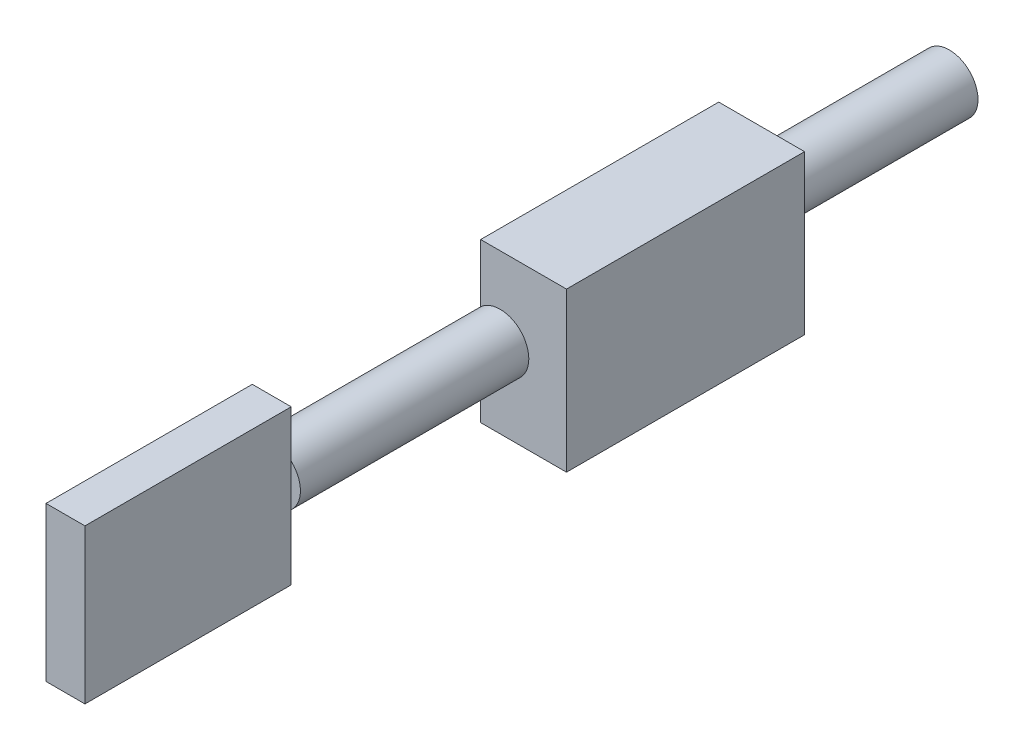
ISO-10303-21;
HEADER;
FILE_DESCRIPTION(('STEP AP214'),'2;1');
FILE_NAME('part.step','',(''),(''),'','','');
FILE_SCHEMA(('AUTOMOTIVE_DESIGN { 1 0 10303 214 1 1 1 1 }'));
ENDSEC;
DATA;
#1=APPLICATION_CONTEXT('core data for automotive mechanical design processes');
#2=APPLICATION_PROTOCOL_DEFINITION('international standard','automotive_design',2000,#1);
#3=PRODUCT_CONTEXT('',#1,'mechanical');
#4=PRODUCT('Part','Part','',(#3));
#5=PRODUCT_RELATED_PRODUCT_CATEGORY('part','',(#4));
#6=PRODUCT_DEFINITION_FORMATION('','',#4);
#7=PRODUCT_DEFINITION_CONTEXT('part definition',#1,'design');
#8=PRODUCT_DEFINITION('design','',#6,#7);
#9=PRODUCT_DEFINITION_SHAPE('','',#8);
#10=(LENGTH_UNIT() NAMED_UNIT(*) SI_UNIT(.MILLI.,.METRE.));
#11=(NAMED_UNIT(*) PLANE_ANGLE_UNIT() SI_UNIT($,.RADIAN.));
#12=(NAMED_UNIT(*) SI_UNIT($,.STERADIAN.) SOLID_ANGLE_UNIT());
#13=UNCERTAINTY_MEASURE_WITH_UNIT(LENGTH_MEASURE(1.E-05),#10,'distance_accuracy_value','');
#14=(GEOMETRIC_REPRESENTATION_CONTEXT(3) GLOBAL_UNCERTAINTY_ASSIGNED_CONTEXT((#13)) GLOBAL_UNIT_ASSIGNED_CONTEXT((#10,
#11,#12)) REPRESENTATION_CONTEXT('',''));
#15=CARTESIAN_POINT('',(0.,0.,0.));
#16=DIRECTION('',(0.,0.,1.));
#17=DIRECTION('',(1.,0.,0.));
#18=AXIS2_PLACEMENT_3D('',#15,#16,#17);
#19=CARTESIAN_POINT('',(0.,0.,121.740764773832));
#20=DIRECTION('',(0.,0.,-1.));
#21=DIRECTION('',(-1.,0.,0.));
#22=AXIS2_PLACEMENT_3D('',#19,#20,#21);
#23=CYLINDRICAL_SURFACE('',#22,4.6);
#24=CARTESIAN_POINT('',(0.,0.,108.73));
#25=DIRECTION('',(0.,0.,1.));
#26=DIRECTION('',(1.,0.,0.));
#27=AXIS2_PLACEMENT_3D('',#24,#25,#26);
#28=CIRCLE('',#27,4.6);
#29=CARTESIAN_POINT('',(3.125,3.37555550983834,108.73));
#30=VERTEX_POINT('',#29);
#31=CARTESIAN_POINT('',(-3.125,3.37555550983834,108.73));
#32=VERTEX_POINT('',#31);
#33=EDGE_CURVE('E218',#30,#32,#28,.T.);
#34=ORIENTED_EDGE('',*,*,#33,.F.);
#35=CARTESIAN_POINT('',(3.125,-3.37555550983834,108.73));
#36=VERTEX_POINT('',#35);
#37=EDGE_CURVE('E217',#36,#30,#28,.T.);
#38=ORIENTED_EDGE('',*,*,#37,.F.);
#39=CARTESIAN_POINT('',(-3.125,-3.37555550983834,108.73));
#40=VERTEX_POINT('',#39);
#41=EDGE_CURVE('E223',#40,#36,#28,.T.);
#42=ORIENTED_EDGE('',*,*,#41,.F.);
#43=EDGE_CURVE('E222',#32,#40,#28,.T.);
#44=ORIENTED_EDGE('',*,*,#43,.F.);
#45=EDGE_LOOP('',(#34,#38,#42,#44));
#46=FACE_BOUND('',#45,.T.);
#47=CARTESIAN_POINT('',(0.,0.,0.));
#48=DIRECTION('',(0.,0.,1.));
#49=DIRECTION('',(1.,0.,0.));
#50=AXIS2_PLACEMENT_3D('',#47,#48,#49);
#51=CIRCLE('',#50,4.6);
#52=CARTESIAN_POINT('',(4.6,0.,0.));
#53=VERTEX_POINT('',#52);
#54=EDGE_CURVE('E214',#53,#53,#51,.T.);
#55=ORIENTED_EDGE('',*,*,#54,.T.);
#56=EDGE_LOOP('',(#55));
#57=FACE_BOUND('',#56,.T.);
#58=DIRECTION('',(0.,0.,-1.));
#59=VECTOR('',#58,1.);
#60=CARTESIAN_POINT('',(-3.125,-3.37555550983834,121.740764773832));
#61=LINE('',#60,#59);
#62=CARTESIAN_POINT('',(-3.125,-3.37555550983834,72.08));
#63=VERTEX_POINT('',#62);
#64=CARTESIAN_POINT('',(-3.125,-3.37555550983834,33.88));
#65=VERTEX_POINT('',#64);
#66=EDGE_CURVE('E14',#63,#65,#61,.T.);
#67=ORIENTED_EDGE('',*,*,#66,.F.);
#68=CARTESIAN_POINT('',(0.,0.,72.08));
#69=DIRECTION('',(0.,0.,-1.));
#70=DIRECTION('',(-1.,0.,0.));
#71=AXIS2_PLACEMENT_3D('',#68,#69,#70);
#72=CIRCLE('',#71,4.6);
#73=CARTESIAN_POINT('',(-3.125,3.37555550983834,72.08));
#74=VERTEX_POINT('',#73);
#75=EDGE_CURVE('E60',#74,#63,#72,.T.);
#76=ORIENTED_EDGE('',*,*,#75,.F.);
#77=DIRECTION('',(0.,0.,-1.));
#78=VECTOR('',#77,1.);
#79=CARTESIAN_POINT('',(-3.125,3.37555550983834,121.740764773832));
#80=LINE('',#79,#78);
#81=CARTESIAN_POINT('',(-3.125,3.37555550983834,33.88));
#82=VERTEX_POINT('',#81);
#83=EDGE_CURVE('E267',#82,#74,#80,.F.);
#84=ORIENTED_EDGE('',*,*,#83,.F.);
#85=CARTESIAN_POINT('',(0.,0.,33.88));
#86=DIRECTION('',(0.,0.,1.));
#87=DIRECTION('',(1.,0.,0.));
#88=AXIS2_PLACEMENT_3D('',#85,#86,#87);
#89=CIRCLE('',#88,4.6);
#90=EDGE_CURVE('E75',#65,#82,#89,.T.);
#91=ORIENTED_EDGE('',*,*,#90,.F.);
#92=EDGE_LOOP('',(#67,#76,#84,#91));
#93=FACE_BOUND('',#92,.T.);
#94=ADVANCED_FACE('F51',(#46,#57,#93),#23,.T.);
#95=CARTESIAN_POINT('',(3.125,10.93,108.73));
#96=DIRECTION('',(0.,0.,1.));
#97=DIRECTION('',(1.,0.,0.));
#98=AXIS2_PLACEMENT_3D('',#95,#96,#97);
#99=PLANE('',#98);
#100=DIRECTION('',(0.,1.,0.));
#101=VECTOR('',#100,1.);
#102=CARTESIAN_POINT('',(3.125,10.93,108.73));
#103=LINE('',#102,#101);
#104=CARTESIAN_POINT('',(3.125,10.93,108.73));
#105=VERTEX_POINT('',#104);
#106=EDGE_CURVE('E231',#30,#105,#103,.T.);
#107=ORIENTED_EDGE('',*,*,#106,.F.);
#108=ORIENTED_EDGE('',*,*,#33,.T.);
#109=DIRECTION('',(0.,1.,0.));
#110=VECTOR('',#109,1.);
#111=CARTESIAN_POINT('',(-3.125,10.93,108.73));
#112=LINE('',#111,#110);
#113=CARTESIAN_POINT('',(-3.125,10.93,108.73));
#114=VERTEX_POINT('',#113);
#115=EDGE_CURVE('E246',#32,#114,#112,.T.);
#116=ORIENTED_EDGE('',*,*,#115,.T.);
#117=DIRECTION('',(-1.,0.,0.));
#118=VECTOR('',#117,1.);
#119=CARTESIAN_POINT('',(3.125,10.93,108.73));
#120=LINE('',#119,#118);
#121=EDGE_CURVE('E256',#105,#114,#120,.T.);
#122=ORIENTED_EDGE('',*,*,#121,.F.);
#123=EDGE_LOOP('',(#107,#108,#116,#122));
#124=FACE_BOUND('',#123,.T.);
#125=ADVANCED_FACE('F285',(#124),#99,.F.);
#126=CARTESIAN_POINT('',(3.125,10.93,141.83));
#127=DIRECTION('',(0.,0.,-1.));
#128=DIRECTION('',(-1.,0.,0.));
#129=AXIS2_PLACEMENT_3D('',#126,#127,#128);
#130=PLANE('',#129);
#131=DIRECTION('',(0.,-1.,0.));
#132=VECTOR('',#131,1.);
#133=CARTESIAN_POINT('',(-3.125,10.93,141.83));
#134=LINE('',#133,#132);
#135=CARTESIAN_POINT('',(-3.125,10.93,141.83));
#136=VERTEX_POINT('',#135);
#137=CARTESIAN_POINT('',(-3.125,-13.82,141.83));
#138=VERTEX_POINT('',#137);
#139=EDGE_CURVE('E221',#136,#138,#134,.T.);
#140=ORIENTED_EDGE('',*,*,#139,.T.);
#141=DIRECTION('',(-1.,0.,0.));
#142=VECTOR('',#141,1.);
#143=CARTESIAN_POINT('',(3.125,-13.82,141.83));
#144=LINE('',#143,#142);
#145=CARTESIAN_POINT('',(3.125,-13.82,141.83));
#146=VERTEX_POINT('',#145);
#147=EDGE_CURVE('E264',#146,#138,#144,.T.);
#148=ORIENTED_EDGE('',*,*,#147,.F.);
#149=DIRECTION('',(0.,-1.,0.));
#150=VECTOR('',#149,1.);
#151=CARTESIAN_POINT('',(3.125,10.93,141.83));
#152=LINE('',#151,#150);
#153=CARTESIAN_POINT('',(3.125,10.93,141.83));
#154=VERTEX_POINT('',#153);
#155=EDGE_CURVE('E224',#154,#146,#152,.T.);
#156=ORIENTED_EDGE('',*,*,#155,.F.);
#157=DIRECTION('',(-1.,0.,0.));
#158=VECTOR('',#157,1.);
#159=CARTESIAN_POINT('',(3.125,10.93,141.83));
#160=LINE('',#159,#158);
#161=EDGE_CURVE('E240',#154,#136,#160,.T.);
#162=ORIENTED_EDGE('',*,*,#161,.T.);
#163=EDGE_LOOP('',(#140,#148,#156,#162));
#164=FACE_BOUND('',#163,.T.);
#165=ADVANCED_FACE('F53',(#164),#130,.F.);
#166=CARTESIAN_POINT('',(3.125,-13.82,141.83));
#167=DIRECTION('',(0.,1.,0.));
#168=DIRECTION('',(0.,0.,1.));
#169=AXIS2_PLACEMENT_3D('',#166,#167,#168);
#170=PLANE('',#169);
#171=DIRECTION('',(0.,0.,-1.));
#172=VECTOR('',#171,1.);
#173=CARTESIAN_POINT('',(-3.125,-13.82,141.83));
#174=LINE('',#173,#172);
#175=CARTESIAN_POINT('',(-3.125,-13.82,108.73));
#176=VERTEX_POINT('',#175);
#177=EDGE_CURVE('E243',#138,#176,#174,.T.);
#178=ORIENTED_EDGE('',*,*,#177,.T.);
#179=DIRECTION('',(-1.,0.,0.));
#180=VECTOR('',#179,1.);
#181=CARTESIAN_POINT('',(3.125,-13.82,108.73));
#182=LINE('',#181,#180);
#183=CARTESIAN_POINT('',(3.125,-13.82,108.73));
#184=VERTEX_POINT('',#183);
#185=EDGE_CURVE('E260',#184,#176,#182,.T.);
#186=ORIENTED_EDGE('',*,*,#185,.F.);
#187=DIRECTION('',(0.,0.,-1.));
#188=VECTOR('',#187,1.);
#189=CARTESIAN_POINT('',(3.125,-13.82,141.83));
#190=LINE('',#189,#188);
#191=EDGE_CURVE('E227',#146,#184,#190,.T.);
#192=ORIENTED_EDGE('',*,*,#191,.F.);
#193=ORIENTED_EDGE('',*,*,#147,.T.);
#194=EDGE_LOOP('',(#178,#186,#192,#193));
#195=FACE_BOUND('',#194,.T.);
#196=ADVANCED_FACE('F317',(#195),#170,.F.);
#197=EDGE_CURVE('E247',#176,#40,#112,.T.);
#198=ORIENTED_EDGE('',*,*,#197,.T.);
#199=ORIENTED_EDGE('',*,*,#41,.T.);
#200=EDGE_CURVE('E232',#184,#36,#103,.T.);
#201=ORIENTED_EDGE('',*,*,#200,.F.);
#202=ORIENTED_EDGE('',*,*,#185,.T.);
#203=EDGE_LOOP('',(#198,#199,#201,#202));
#204=FACE_BOUND('',#203,.T.);
#205=ADVANCED_FACE('F293',(#204),#99,.F.);
#206=CARTESIAN_POINT('',(3.125,10.93,141.83));
#207=DIRECTION('',(0.,-1.,0.));
#208=DIRECTION('',(0.,0.,-1.));
#209=AXIS2_PLACEMENT_3D('',#206,#207,#208);
#210=PLANE('',#209);
#211=DIRECTION('',(0.,0.,1.));
#212=VECTOR('',#211,1.);
#213=CARTESIAN_POINT('',(-3.125,10.93,141.83));
#214=LINE('',#213,#212);
#215=EDGE_CURVE('E228',#114,#136,#214,.T.);
#216=ORIENTED_EDGE('',*,*,#215,.T.);
#217=ORIENTED_EDGE('',*,*,#161,.F.);
#218=DIRECTION('',(0.,0.,1.));
#219=VECTOR('',#218,1.);
#220=CARTESIAN_POINT('',(3.125,10.93,141.83));
#221=LINE('',#220,#219);
#222=EDGE_CURVE('E236',#105,#154,#221,.T.);
#223=ORIENTED_EDGE('',*,*,#222,.F.);
#224=ORIENTED_EDGE('',*,*,#121,.T.);
#225=EDGE_LOOP('',(#216,#217,#223,#224));
#226=FACE_BOUND('',#225,.T.);
#227=ADVANCED_FACE('F309',(#226),#210,.F.);
#228=CARTESIAN_POINT('',(3.125,0.,0.));
#229=DIRECTION('',(1.,0.,0.));
#230=DIRECTION('',(0.,0.,-1.));
#231=AXIS2_PLACEMENT_3D('',#228,#229,#230);
#232=PLANE('',#231);
#233=ORIENTED_EDGE('',*,*,#155,.T.);
#234=ORIENTED_EDGE('',*,*,#191,.T.);
#235=ORIENTED_EDGE('',*,*,#200,.T.);
#236=EDGE_CURVE('E237',#36,#30,#103,.T.);
#237=ORIENTED_EDGE('',*,*,#236,.T.);
#238=ORIENTED_EDGE('',*,*,#106,.T.);
#239=ORIENTED_EDGE('',*,*,#222,.T.);
#240=EDGE_LOOP('',(#233,#234,#235,#237,#238,#239));
#241=FACE_BOUND('',#240,.T.);
#242=ADVANCED_FACE('F305',(#241),#232,.T.);
#243=CARTESIAN_POINT('',(-3.125,0.,0.));
#244=DIRECTION('',(1.,0.,0.));
#245=DIRECTION('',(0.,0.,-1.));
#246=AXIS2_PLACEMENT_3D('',#243,#244,#245);
#247=PLANE('',#246);
#248=ORIENTED_EDGE('',*,*,#139,.F.);
#249=ORIENTED_EDGE('',*,*,#215,.F.);
#250=ORIENTED_EDGE('',*,*,#115,.F.);
#251=EDGE_CURVE('E251',#40,#32,#112,.T.);
#252=ORIENTED_EDGE('',*,*,#251,.F.);
#253=ORIENTED_EDGE('',*,*,#197,.F.);
#254=ORIENTED_EDGE('',*,*,#177,.F.);
#255=EDGE_LOOP('',(#248,#249,#250,#252,#253,#254));
#256=FACE_BOUND('',#255,.T.);
#257=ADVANCED_FACE('F308',(#256),#247,.F.);
#258=CARTESIAN_POINT('',(3.125,10.93,108.73));
#259=DIRECTION('',(0.,0.,1.));
#260=DIRECTION('',(1.,0.,0.));
#261=AXIS2_PLACEMENT_3D('',#258,#259,#260);
#262=PLANE('',#261);
#263=ORIENTED_EDGE('',*,*,#236,.F.);
#264=ORIENTED_EDGE('',*,*,#37,.T.);
#265=EDGE_LOOP('',(#263,#264));
#266=FACE_BOUND('',#265,.T.);
#267=ADVANCED_FACE('F304',(#266),#262,.T.);
#268=CARTESIAN_POINT('',(0.,0.,0.));
#269=DIRECTION('',(0.,0.,1.));
#270=DIRECTION('',(1.,0.,0.));
#271=AXIS2_PLACEMENT_3D('',#268,#269,#270);
#272=PLANE('',#271);
#273=ORIENTED_EDGE('',*,*,#54,.F.);
#274=EDGE_LOOP('',(#273));
#275=FACE_BOUND('',#274,.T.);
#276=ADVANCED_FACE('F298',(#275),#272,.F.);
#277=ORIENTED_EDGE('',*,*,#43,.T.);
#278=ORIENTED_EDGE('',*,*,#251,.T.);
#279=EDGE_LOOP('',(#277,#278));
#280=FACE_BOUND('',#279,.T.);
#281=ADVANCED_FACE('F300',(#280),#262,.T.);
#282=CARTESIAN_POINT('',(-3.125,0.,0.));
#283=DIRECTION('',(1.,0.,0.));
#284=DIRECTION('',(0.,0.,-1.));
#285=AXIS2_PLACEMENT_3D('',#282,#283,#284);
#286=PLANE('',#285);
#287=DIRECTION('',(0.,-1.,0.));
#288=VECTOR('',#287,1.);
#289=CARTESIAN_POINT('',(-3.125,12.725,72.08));
#290=LINE('',#289,#288);
#291=CARTESIAN_POINT('',(-3.125,-12.725,72.08));
#292=VERTEX_POINT('',#291);
#293=EDGE_CURVE('E184',#63,#292,#290,.T.);
#294=ORIENTED_EDGE('',*,*,#293,.F.);
#295=ORIENTED_EDGE('',*,*,#66,.T.);
#296=DIRECTION('',(0.,1.,0.));
#297=VECTOR('',#296,1.);
#298=CARTESIAN_POINT('',(-3.125,12.725,33.88));
#299=LINE('',#298,#297);
#300=CARTESIAN_POINT('',(-3.125,-12.725,33.88));
#301=VERTEX_POINT('',#300);
#302=EDGE_CURVE('E201',#301,#65,#299,.T.);
#303=ORIENTED_EDGE('',*,*,#302,.F.);
#304=DIRECTION('',(0.,0.,-1.));
#305=VECTOR('',#304,1.);
#306=CARTESIAN_POINT('',(-3.125,-12.725,72.08));
#307=LINE('',#306,#305);
#308=EDGE_CURVE('E197',#292,#301,#307,.T.);
#309=ORIENTED_EDGE('',*,*,#308,.F.);
#310=EDGE_LOOP('',(#294,#295,#303,#309));
#311=FACE_BOUND('',#310,.T.);
#312=ADVANCED_FACE('F275',(#311),#286,.F.);
#313=CARTESIAN_POINT('',(-3.125,12.725,33.88));
#314=VERTEX_POINT('',#313);
#315=EDGE_CURVE('E200',#82,#314,#299,.T.);
#316=ORIENTED_EDGE('',*,*,#315,.F.);
#317=ORIENTED_EDGE('',*,*,#83,.T.);
#318=CARTESIAN_POINT('',(-3.125,12.725,72.08));
#319=VERTEX_POINT('',#318);
#320=EDGE_CURVE('E189',#319,#74,#290,.T.);
#321=ORIENTED_EDGE('',*,*,#320,.F.);
#322=DIRECTION('',(0.,0.,1.));
#323=VECTOR('',#322,1.);
#324=CARTESIAN_POINT('',(-3.125,12.725,72.08));
#325=LINE('',#324,#323);
#326=EDGE_CURVE('E162',#314,#319,#325,.T.);
#327=ORIENTED_EDGE('',*,*,#326,.F.);
#328=EDGE_LOOP('',(#316,#317,#321,#327));
#329=FACE_BOUND('',#328,.T.);
#330=ADVANCED_FACE('F283',(#329),#286,.F.);
#331=CARTESIAN_POINT('',(3.125,12.725,72.08));
#332=DIRECTION('',(0.,0.,-1.));
#333=DIRECTION('',(-1.,0.,0.));
#334=AXIS2_PLACEMENT_3D('',#331,#332,#333);
#335=PLANE('',#334);
#336=ORIENTED_EDGE('',*,*,#320,.T.);
#337=ORIENTED_EDGE('',*,*,#75,.T.);
#338=ORIENTED_EDGE('',*,*,#293,.T.);
#339=DIRECTION('',(-1.,0.,0.));
#340=VECTOR('',#339,1.);
#341=CARTESIAN_POINT('',(3.125,-12.725,72.08));
#342=LINE('',#341,#340);
#343=CARTESIAN_POINT('',(10.65,-12.725,72.08));
#344=VERTEX_POINT('',#343);
#345=EDGE_CURVE('E173',#344,#292,#342,.T.);
#346=ORIENTED_EDGE('',*,*,#345,.F.);
#347=DIRECTION('',(0.,-1.,0.));
#348=VECTOR('',#347,1.);
#349=CARTESIAN_POINT('',(10.65,0.,72.08));
#350=LINE('',#349,#348);
#351=CARTESIAN_POINT('',(10.65,12.725,72.08));
#352=VERTEX_POINT('',#351);
#353=EDGE_CURVE('E170',#352,#344,#350,.T.);
#354=ORIENTED_EDGE('',*,*,#353,.F.);
#355=DIRECTION('',(-1.,0.,0.));
#356=VECTOR('',#355,1.);
#357=CARTESIAN_POINT('',(3.125,12.725,72.08));
#358=LINE('',#357,#356);
#359=EDGE_CURVE('E154',#352,#319,#358,.T.);
#360=ORIENTED_EDGE('',*,*,#359,.T.);
#361=EDGE_LOOP('',(#336,#337,#338,#346,#354,#360));
#362=FACE_BOUND('',#361,.T.);
#363=ADVANCED_FACE('F171',(#362),#335,.F.);
#364=CARTESIAN_POINT('',(3.125,-12.725,72.08));
#365=DIRECTION('',(0.,1.,0.));
#366=DIRECTION('',(0.,0.,1.));
#367=AXIS2_PLACEMENT_3D('',#364,#365,#366);
#368=PLANE('',#367);
#369=ORIENTED_EDGE('',*,*,#308,.T.);
#370=DIRECTION('',(-1.,0.,0.));
#371=VECTOR('',#370,1.);
#372=CARTESIAN_POINT('',(3.125,-12.725,33.88));
#373=LINE('',#372,#371);
#374=CARTESIAN_POINT('',(10.65,-12.725,33.88));
#375=VERTEX_POINT('',#374);
#376=EDGE_CURVE('E208',#375,#301,#373,.T.);
#377=ORIENTED_EDGE('',*,*,#376,.F.);
#378=DIRECTION('',(0.,0.,-1.));
#379=VECTOR('',#378,1.);
#380=CARTESIAN_POINT('',(10.65,-12.725,0.));
#381=LINE('',#380,#379);
#382=EDGE_CURVE('E178',#344,#375,#381,.T.);
#383=ORIENTED_EDGE('',*,*,#382,.F.);
#384=ORIENTED_EDGE('',*,*,#345,.T.);
#385=EDGE_LOOP('',(#369,#377,#383,#384));
#386=FACE_BOUND('',#385,.T.);
#387=ADVANCED_FACE('F278',(#386),#368,.F.);
#388=CARTESIAN_POINT('',(3.125,12.725,33.88));
#389=DIRECTION('',(0.,0.,1.));
#390=DIRECTION('',(1.,0.,0.));
#391=AXIS2_PLACEMENT_3D('',#388,#389,#390);
#392=PLANE('',#391);
#393=ORIENTED_EDGE('',*,*,#302,.T.);
#394=ORIENTED_EDGE('',*,*,#90,.T.);
#395=ORIENTED_EDGE('',*,*,#315,.T.);
#396=DIRECTION('',(-1.,0.,0.));
#397=VECTOR('',#396,1.);
#398=CARTESIAN_POINT('',(3.125,12.725,33.88));
#399=LINE('',#398,#397);
#400=CARTESIAN_POINT('',(10.65,12.725,33.88));
#401=VERTEX_POINT('',#400);
#402=EDGE_CURVE('E167',#401,#314,#399,.T.);
#403=ORIENTED_EDGE('',*,*,#402,.F.);
#404=DIRECTION('',(0.,1.,0.));
#405=VECTOR('',#404,1.);
#406=CARTESIAN_POINT('',(10.65,0.,33.88));
#407=LINE('',#406,#405);
#408=EDGE_CURVE('E182',#375,#401,#407,.T.);
#409=ORIENTED_EDGE('',*,*,#408,.F.);
#410=ORIENTED_EDGE('',*,*,#376,.T.);
#411=EDGE_LOOP('',(#393,#394,#395,#403,#409,#410));
#412=FACE_BOUND('',#411,.T.);
#413=ADVANCED_FACE('F280',(#412),#392,.F.);
#414=CARTESIAN_POINT('',(3.125,12.725,72.08));
#415=DIRECTION('',(0.,-1.,0.));
#416=DIRECTION('',(0.,0.,-1.));
#417=AXIS2_PLACEMENT_3D('',#414,#415,#416);
#418=PLANE('',#417);
#419=ORIENTED_EDGE('',*,*,#326,.T.);
#420=ORIENTED_EDGE('',*,*,#359,.F.);
#421=DIRECTION('',(0.,0.,1.));
#422=VECTOR('',#421,1.);
#423=CARTESIAN_POINT('',(10.65,12.725,0.));
#424=LINE('',#423,#422);
#425=EDGE_CURVE('E159',#401,#352,#424,.T.);
#426=ORIENTED_EDGE('',*,*,#425,.F.);
#427=ORIENTED_EDGE('',*,*,#402,.T.);
#428=EDGE_LOOP('',(#419,#420,#426,#427));
#429=FACE_BOUND('',#428,.T.);
#430=ADVANCED_FACE('F156',(#429),#418,.F.);
#431=CARTESIAN_POINT('',(10.65,0.,0.));
#432=DIRECTION('',(1.,0.,0.));
#433=DIRECTION('',(0.,0.,-1.));
#434=AXIS2_PLACEMENT_3D('',#431,#432,#433);
#435=PLANE('',#434);
#436=ORIENTED_EDGE('',*,*,#353,.T.);
#437=ORIENTED_EDGE('',*,*,#382,.T.);
#438=ORIENTED_EDGE('',*,*,#408,.T.);
#439=ORIENTED_EDGE('',*,*,#425,.T.);
#440=EDGE_LOOP('',(#436,#437,#438,#439));
#441=FACE_BOUND('',#440,.T.);
#442=ADVANCED_FACE('F180',(#441),#435,.T.);
#443=CLOSED_SHELL('',(#94,#125,#165,#196,#205,#227,#242,#257,#267,#276,#281,#312,#330,#363,#387,
#413,#430,#442));
#444=MANIFOLD_SOLID_BREP('B2',#443);
#445=ADVANCED_BREP_SHAPE_REPRESENTATION('',(#18,#444),#14);
#446=SHAPE_DEFINITION_REPRESENTATION(#9,#445);
ENDSEC;
END-ISO-10303-21;
